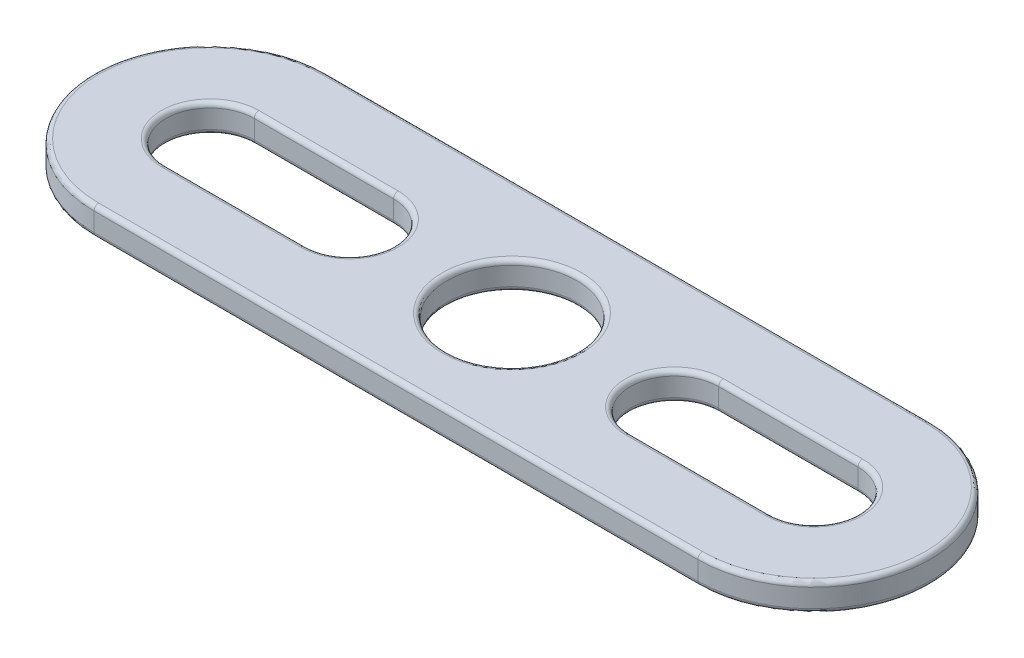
ISO-10303-21;
HEADER;
FILE_DESCRIPTION(('STEP AP214'),'2;1');
FILE_NAME('part.step','',(''),(''),'','','');
FILE_SCHEMA(('AUTOMOTIVE_DESIGN { 1 0 10303 214 1 1 1 1 }'));
ENDSEC;
DATA;
#1=APPLICATION_CONTEXT('core data for automotive mechanical design processes');
#2=APPLICATION_PROTOCOL_DEFINITION('international standard','automotive_design',2000,#1);
#3=PRODUCT_CONTEXT('',#1,'mechanical');
#4=PRODUCT('Part','Part','',(#3));
#5=PRODUCT_RELATED_PRODUCT_CATEGORY('part','',(#4));
#6=PRODUCT_DEFINITION_FORMATION('','',#4);
#7=PRODUCT_DEFINITION_CONTEXT('part definition',#1,'design');
#8=PRODUCT_DEFINITION('design','',#6,#7);
#9=PRODUCT_DEFINITION_SHAPE('','',#8);
#10=(LENGTH_UNIT() NAMED_UNIT(*) SI_UNIT(.MILLI.,.METRE.));
#11=(NAMED_UNIT(*) PLANE_ANGLE_UNIT() SI_UNIT($,.RADIAN.));
#12=(NAMED_UNIT(*) SI_UNIT($,.STERADIAN.) SOLID_ANGLE_UNIT());
#13=UNCERTAINTY_MEASURE_WITH_UNIT(LENGTH_MEASURE(1.E-05),#10,'distance_accuracy_value','');
#14=(GEOMETRIC_REPRESENTATION_CONTEXT(3) GLOBAL_UNCERTAINTY_ASSIGNED_CONTEXT((#13)) GLOBAL_UNIT_ASSIGNED_CONTEXT((#10,
#11,#12)) REPRESENTATION_CONTEXT('',''));
#15=CARTESIAN_POINT('',(0.,0.,0.));
#16=DIRECTION('',(0.,0.,1.));
#17=DIRECTION('',(1.,0.,0.));
#18=AXIS2_PLACEMENT_3D('',#15,#16,#17);
#19=CARTESIAN_POINT('',(0.,1.524,-6.35));
#20=DIRECTION('',(0.,1.,0.));
#21=DIRECTION('',(0.,0.,1.));
#22=AXIS2_PLACEMENT_3D('',#19,#20,#21);
#23=PLANE('',#22);
#24=DIRECTION('',(-1.,0.,0.));
#25=VECTOR('',#24,1.);
#26=CARTESIAN_POINT('',(0.,1.524,-9.01700000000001));
#27=LINE('',#26,#25);
#28=CARTESIAN_POINT('',(25.4,1.524,-9.017));
#29=VERTEX_POINT('',#28);
#30=CARTESIAN_POINT('',(33.02,1.524,-9.017));
#31=VERTEX_POINT('',#30);
#32=EDGE_CURVE('E34',#29,#31,#27,.F.);
#33=ORIENTED_EDGE('',*,*,#32,.T.);
#34=CARTESIAN_POINT('',(33.02,1.524,-6.35));
#35=DIRECTION('',(0.,1.,0.));
#36=DIRECTION('',(0.,0.,1.));
#37=AXIS2_PLACEMENT_3D('',#34,#35,#36);
#38=CIRCLE('',#37,2.667);
#39=CARTESIAN_POINT('',(33.02,1.524,-3.683));
#40=VERTEX_POINT('',#39);
#41=EDGE_CURVE('E11',#31,#40,#38,.F.);
#42=ORIENTED_EDGE('',*,*,#41,.T.);
#43=DIRECTION('',(1.,0.,0.));
#44=VECTOR('',#43,1.);
#45=CARTESIAN_POINT('',(0.,1.524,-3.683));
#46=LINE('',#45,#44);
#47=CARTESIAN_POINT('',(25.4,1.524,-3.683));
#48=VERTEX_POINT('',#47);
#49=EDGE_CURVE('E316',#40,#48,#46,.F.);
#50=ORIENTED_EDGE('',*,*,#49,.T.);
#51=CARTESIAN_POINT('',(25.4,1.524,-6.35));
#52=DIRECTION('',(0.,1.,0.));
#53=DIRECTION('',(0.,0.,1.));
#54=AXIS2_PLACEMENT_3D('',#51,#52,#53);
#55=CIRCLE('',#54,2.667);
#56=EDGE_CURVE('E44',#48,#29,#55,.F.);
#57=ORIENTED_EDGE('',*,*,#56,.T.);
#58=EDGE_LOOP('',(#33,#42,#50,#57));
#59=FACE_BOUND('',#58,.T.);
#60=CARTESIAN_POINT('',(16.51,1.524,-6.35));
#61=DIRECTION('',(0.,1.,0.));
#62=DIRECTION('',(0.,0.,1.));
#63=AXIS2_PLACEMENT_3D('',#60,#61,#62);
#64=CIRCLE('',#63,3.81);
#65=CARTESIAN_POINT('',(16.51,1.524,-2.54));
#66=VERTEX_POINT('',#65);
#67=EDGE_CURVE('E313',#66,#66,#64,.F.);
#68=ORIENTED_EDGE('',*,*,#67,.T.);
#69=EDGE_LOOP('',(#68));
#70=FACE_BOUND('',#69,.T.);
#71=CARTESIAN_POINT('',(33.02,1.524,-6.35));
#72=DIRECTION('',(0.,1.,0.));
#73=DIRECTION('',(0.,0.,1.));
#74=AXIS2_PLACEMENT_3D('',#71,#72,#73);
#75=CIRCLE('',#74,6.096);
#76=CARTESIAN_POINT('',(33.02,1.524,-0.254));
#77=VERTEX_POINT('',#76);
#78=CARTESIAN_POINT('',(33.02,1.524,-12.446));
#79=VERTEX_POINT('',#78);
#80=EDGE_CURVE('E308',#77,#79,#75,.T.);
#81=ORIENTED_EDGE('',*,*,#80,.T.);
#82=DIRECTION('',(-1.,0.,0.));
#83=VECTOR('',#82,1.);
#84=CARTESIAN_POINT('',(0.,1.524,-12.446));
#85=LINE('',#84,#83);
#86=CARTESIAN_POINT('',(0.,1.524,-12.446));
#87=VERTEX_POINT('',#86);
#88=EDGE_CURVE('E310',#79,#87,#85,.T.);
#89=ORIENTED_EDGE('',*,*,#88,.T.);
#90=CARTESIAN_POINT('',(0.,1.524,-6.35));
#91=DIRECTION('',(0.,1.,0.));
#92=DIRECTION('',(0.,0.,1.));
#93=AXIS2_PLACEMENT_3D('',#90,#91,#92);
#94=CIRCLE('',#93,6.096);
#95=CARTESIAN_POINT('',(0.,1.524,-0.254));
#96=VERTEX_POINT('',#95);
#97=EDGE_CURVE('E304',#87,#96,#94,.T.);
#98=ORIENTED_EDGE('',*,*,#97,.T.);
#99=DIRECTION('',(1.,0.,0.));
#100=VECTOR('',#99,1.);
#101=CARTESIAN_POINT('',(33.02,1.524,-0.254));
#102=LINE('',#101,#100);
#103=EDGE_CURVE('E306',#96,#77,#102,.T.);
#104=ORIENTED_EDGE('',*,*,#103,.T.);
#105=EDGE_LOOP('',(#81,#89,#98,#104));
#106=FACE_BOUND('',#105,.T.);
#107=DIRECTION('',(-1.,0.,0.));
#108=VECTOR('',#107,1.);
#109=CARTESIAN_POINT('',(0.,1.524,-9.017));
#110=LINE('',#109,#108);
#111=CARTESIAN_POINT('',(0.,1.524,-9.017));
#112=VERTEX_POINT('',#111);
#113=CARTESIAN_POINT('',(7.62,1.524,-9.017));
#114=VERTEX_POINT('',#113);
#115=EDGE_CURVE('E299',#112,#114,#110,.F.);
#116=ORIENTED_EDGE('',*,*,#115,.T.);
#117=CARTESIAN_POINT('',(7.62,1.524,-6.35));
#118=DIRECTION('',(0.,1.,0.));
#119=DIRECTION('',(0.,0.,1.));
#120=AXIS2_PLACEMENT_3D('',#117,#118,#119);
#121=CIRCLE('',#120,2.667);
#122=CARTESIAN_POINT('',(7.62,1.524,-3.683));
#123=VERTEX_POINT('',#122);
#124=EDGE_CURVE('E301',#114,#123,#121,.F.);
#125=ORIENTED_EDGE('',*,*,#124,.T.);
#126=DIRECTION('',(1.,0.,0.));
#127=VECTOR('',#126,1.);
#128=CARTESIAN_POINT('',(0.,1.524,-3.683));
#129=LINE('',#128,#127);
#130=CARTESIAN_POINT('',(0.,1.524,-3.683));
#131=VERTEX_POINT('',#130);
#132=EDGE_CURVE('E295',#123,#131,#129,.F.);
#133=ORIENTED_EDGE('',*,*,#132,.T.);
#134=CARTESIAN_POINT('',(0.,1.524,-6.35));
#135=DIRECTION('',(0.,1.,0.));
#136=DIRECTION('',(0.,0.,1.));
#137=AXIS2_PLACEMENT_3D('',#134,#135,#136);
#138=CIRCLE('',#137,2.667);
#139=EDGE_CURVE('E297',#131,#112,#138,.F.);
#140=ORIENTED_EDGE('',*,*,#139,.T.);
#141=EDGE_LOOP('',(#116,#125,#133,#140));
#142=FACE_BOUND('',#141,.T.);
#143=ADVANCED_FACE('F26',(#59,#70,#106,#142),#23,.T.);
#144=CARTESIAN_POINT('',(0.,0.,-6.35));
#145=DIRECTION('',(0.,1.,0.));
#146=DIRECTION('',(0.,0.,1.));
#147=AXIS2_PLACEMENT_3D('',#144,#145,#146);
#148=PLANE('',#147);
#149=CARTESIAN_POINT('',(33.02,0.,-6.35));
#150=DIRECTION('',(0.,1.,0.));
#151=DIRECTION('',(0.,0.,1.));
#152=AXIS2_PLACEMENT_3D('',#149,#150,#151);
#153=CIRCLE('',#152,2.667);
#154=CARTESIAN_POINT('',(33.02,0.,-3.683));
#155=VERTEX_POINT('',#154);
#156=CARTESIAN_POINT('',(33.02,0.,-9.017));
#157=VERTEX_POINT('',#156);
#158=EDGE_CURVE('E232',#155,#157,#153,.T.);
#159=ORIENTED_EDGE('',*,*,#158,.T.);
#160=DIRECTION('',(-1.,0.,0.));
#161=VECTOR('',#160,1.);
#162=CARTESIAN_POINT('',(25.4,0.,-9.017));
#163=LINE('',#162,#161);
#164=CARTESIAN_POINT('',(25.4,0.,-9.017));
#165=VERTEX_POINT('',#164);
#166=EDGE_CURVE('E234',#157,#165,#163,.T.);
#167=ORIENTED_EDGE('',*,*,#166,.T.);
#168=CARTESIAN_POINT('',(25.4,0.,-6.35));
#169=DIRECTION('',(0.,1.,0.));
#170=DIRECTION('',(0.,0.,1.));
#171=AXIS2_PLACEMENT_3D('',#168,#169,#170);
#172=CIRCLE('',#171,2.667);
#173=CARTESIAN_POINT('',(25.4,0.,-3.683));
#174=VERTEX_POINT('',#173);
#175=EDGE_CURVE('E228',#165,#174,#172,.T.);
#176=ORIENTED_EDGE('',*,*,#175,.T.);
#177=DIRECTION('',(1.,0.,0.));
#178=VECTOR('',#177,1.);
#179=CARTESIAN_POINT('',(33.02,0.,-3.683));
#180=LINE('',#179,#178);
#181=EDGE_CURVE('E230',#174,#155,#180,.T.);
#182=ORIENTED_EDGE('',*,*,#181,.T.);
#183=EDGE_LOOP('',(#159,#167,#176,#182));
#184=FACE_BOUND('',#183,.T.);
#185=CARTESIAN_POINT('',(16.51,0.,-6.35));
#186=DIRECTION('',(0.,1.,0.));
#187=DIRECTION('',(0.,0.,1.));
#188=AXIS2_PLACEMENT_3D('',#185,#186,#187);
#189=CIRCLE('',#188,3.81);
#190=CARTESIAN_POINT('',(16.51,0.,-2.54));
#191=VERTEX_POINT('',#190);
#192=EDGE_CURVE('E225',#191,#191,#189,.T.);
#193=ORIENTED_EDGE('',*,*,#192,.T.);
#194=EDGE_LOOP('',(#193));
#195=FACE_BOUND('',#194,.T.);
#196=CARTESIAN_POINT('',(33.02,0.,-6.35));
#197=DIRECTION('',(0.,1.,0.));
#198=DIRECTION('',(0.,0.,1.));
#199=AXIS2_PLACEMENT_3D('',#196,#197,#198);
#200=CIRCLE('',#199,6.096);
#201=CARTESIAN_POINT('',(33.02,0.,-12.446));
#202=VERTEX_POINT('',#201);
#203=CARTESIAN_POINT('',(33.02,0.,-0.254));
#204=VERTEX_POINT('',#203);
#205=EDGE_CURVE('E220',#202,#204,#200,.F.);
#206=ORIENTED_EDGE('',*,*,#205,.T.);
#207=DIRECTION('',(1.,0.,0.));
#208=VECTOR('',#207,1.);
#209=CARTESIAN_POINT('',(0.,0.,-0.254));
#210=LINE('',#209,#208);
#211=CARTESIAN_POINT('',(0.,0.,-0.254));
#212=VERTEX_POINT('',#211);
#213=EDGE_CURVE('E222',#204,#212,#210,.F.);
#214=ORIENTED_EDGE('',*,*,#213,.T.);
#215=CARTESIAN_POINT('',(0.,0.,-6.35));
#216=DIRECTION('',(0.,1.,0.));
#217=DIRECTION('',(0.,0.,1.));
#218=AXIS2_PLACEMENT_3D('',#215,#216,#217);
#219=CIRCLE('',#218,6.096);
#220=CARTESIAN_POINT('',(0.,0.,-12.446));
#221=VERTEX_POINT('',#220);
#222=EDGE_CURVE('E212',#212,#221,#219,.F.);
#223=ORIENTED_EDGE('',*,*,#222,.T.);
#224=DIRECTION('',(-1.,0.,0.));
#225=VECTOR('',#224,1.);
#226=CARTESIAN_POINT('',(0.,0.,-12.446));
#227=LINE('',#226,#225);
#228=EDGE_CURVE('E214',#221,#202,#227,.F.);
#229=ORIENTED_EDGE('',*,*,#228,.T.);
#230=EDGE_LOOP('',(#206,#214,#223,#229));
#231=FACE_BOUND('',#230,.T.);
#232=CARTESIAN_POINT('',(7.62,0.,-6.35));
#233=DIRECTION('',(0.,1.,0.));
#234=DIRECTION('',(0.,0.,1.));
#235=AXIS2_PLACEMENT_3D('',#232,#233,#234);
#236=CIRCLE('',#235,2.667);
#237=CARTESIAN_POINT('',(7.62,0.,-3.683));
#238=VERTEX_POINT('',#237);
#239=CARTESIAN_POINT('',(7.62,0.,-9.017));
#240=VERTEX_POINT('',#239);
#241=EDGE_CURVE('E210',#238,#240,#236,.T.);
#242=ORIENTED_EDGE('',*,*,#241,.T.);
#243=DIRECTION('',(-1.,0.,0.));
#244=VECTOR('',#243,1.);
#245=CARTESIAN_POINT('',(0.,0.,-9.017));
#246=LINE('',#245,#244);
#247=CARTESIAN_POINT('',(0.,0.,-9.017));
#248=VERTEX_POINT('',#247);
#249=EDGE_CURVE('E190',#240,#248,#246,.T.);
#250=ORIENTED_EDGE('',*,*,#249,.T.);
#251=CARTESIAN_POINT('',(0.,0.,-6.35));
#252=DIRECTION('',(0.,1.,0.));
#253=DIRECTION('',(0.,0.,1.));
#254=AXIS2_PLACEMENT_3D('',#251,#252,#253);
#255=CIRCLE('',#254,2.667);
#256=CARTESIAN_POINT('',(0.,0.,-3.683));
#257=VERTEX_POINT('',#256);
#258=EDGE_CURVE('E199',#248,#257,#255,.T.);
#259=ORIENTED_EDGE('',*,*,#258,.T.);
#260=DIRECTION('',(1.,0.,0.));
#261=VECTOR('',#260,1.);
#262=CARTESIAN_POINT('',(7.62,0.,-3.683));
#263=LINE('',#262,#261);
#264=EDGE_CURVE('E205',#257,#238,#263,.T.);
#265=ORIENTED_EDGE('',*,*,#264,.T.);
#266=EDGE_LOOP('',(#242,#250,#259,#265));
#267=FACE_BOUND('',#266,.T.);
#268=ADVANCED_FACE('F208',(#184,#195,#231,#267),#148,.F.);
#269=CARTESIAN_POINT('',(0.,1.524,-6.35));
#270=DIRECTION('',(0.,-1.,0.));
#271=DIRECTION('',(0.,0.,-1.));
#272=AXIS2_PLACEMENT_3D('',#269,#270,#271);
#273=CYLINDRICAL_SURFACE('',#272,6.35);
#274=DIRECTION('',(0.,-1.,0.));
#275=VECTOR('',#274,1.);
#276=CARTESIAN_POINT('',(0.,1.524,-12.7));
#277=LINE('',#276,#275);
#278=CARTESIAN_POINT('',(0.,1.27,-12.7));
#279=VERTEX_POINT('',#278);
#280=CARTESIAN_POINT('',(0.,0.254000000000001,-12.7));
#281=VERTEX_POINT('',#280);
#282=EDGE_CURVE('E385',#279,#281,#277,.T.);
#283=ORIENTED_EDGE('',*,*,#282,.T.);
#284=CARTESIAN_POINT('',(0.,0.254,-6.35));
#285=DIRECTION('',(0.,1.,0.));
#286=DIRECTION('',(0.,0.,1.));
#287=AXIS2_PLACEMENT_3D('',#284,#285,#286);
#288=CIRCLE('',#287,6.35);
#289=CARTESIAN_POINT('',(0.,0.254000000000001,0.));
#290=VERTEX_POINT('',#289);
#291=EDGE_CURVE('E277',#281,#290,#288,.T.);
#292=ORIENTED_EDGE('',*,*,#291,.T.);
#293=DIRECTION('',(0.,-1.,0.));
#294=VECTOR('',#293,1.);
#295=CARTESIAN_POINT('',(0.,1.524,0.));
#296=LINE('',#295,#294);
#297=CARTESIAN_POINT('',(0.,1.27,0.));
#298=VERTEX_POINT('',#297);
#299=EDGE_CURVE('E206',#298,#290,#296,.T.);
#300=ORIENTED_EDGE('',*,*,#299,.F.);
#301=CARTESIAN_POINT('',(0.,1.27,-6.35));
#302=DIRECTION('',(0.,1.,0.));
#303=DIRECTION('',(0.,0.,1.));
#304=AXIS2_PLACEMENT_3D('',#301,#302,#303);
#305=CIRCLE('',#304,6.35);
#306=EDGE_CURVE('E275',#298,#279,#305,.F.);
#307=ORIENTED_EDGE('',*,*,#306,.T.);
#308=EDGE_LOOP('',(#283,#292,#300,#307));
#309=FACE_BOUND('',#308,.T.);
#310=ADVANCED_FACE('F28',(#309),#273,.T.);
#311=CARTESIAN_POINT('',(0.,1.524,0.));
#312=DIRECTION('',(0.,0.,-1.));
#313=DIRECTION('',(-1.,0.,0.));
#314=AXIS2_PLACEMENT_3D('',#311,#312,#313);
#315=PLANE('',#314);
#316=ORIENTED_EDGE('',*,*,#299,.T.);
#317=DIRECTION('',(1.,0.,0.));
#318=VECTOR('',#317,1.);
#319=CARTESIAN_POINT('',(0.,0.254,0.));
#320=LINE('',#319,#318);
#321=CARTESIAN_POINT('',(33.02,0.254000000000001,0.));
#322=VERTEX_POINT('',#321);
#323=EDGE_CURVE('E263',#290,#322,#320,.T.);
#324=ORIENTED_EDGE('',*,*,#323,.T.);
#325=DIRECTION('',(0.,-1.,0.));
#326=VECTOR('',#325,1.);
#327=CARTESIAN_POINT('',(33.02,1.524,0.));
#328=LINE('',#327,#326);
#329=CARTESIAN_POINT('',(33.02,1.27,0.));
#330=VERTEX_POINT('',#329);
#331=EDGE_CURVE('E391',#330,#322,#328,.T.);
#332=ORIENTED_EDGE('',*,*,#331,.F.);
#333=DIRECTION('',(1.,0.,0.));
#334=VECTOR('',#333,1.);
#335=CARTESIAN_POINT('',(0.,1.27,0.));
#336=LINE('',#335,#334);
#337=EDGE_CURVE('E261',#330,#298,#336,.F.);
#338=ORIENTED_EDGE('',*,*,#337,.T.);
#339=EDGE_LOOP('',(#316,#324,#332,#338));
#340=FACE_BOUND('',#339,.T.);
#341=ADVANCED_FACE('F467',(#340),#315,.F.);
#342=CARTESIAN_POINT('',(33.02,1.524,-6.35));
#343=DIRECTION('',(0.,-1.,0.));
#344=DIRECTION('',(0.,0.,-1.));
#345=AXIS2_PLACEMENT_3D('',#342,#343,#344);
#346=CYLINDRICAL_SURFACE('',#345,6.35);
#347=ORIENTED_EDGE('',*,*,#331,.T.);
#348=CARTESIAN_POINT('',(33.02,0.254,-6.35));
#349=DIRECTION('',(0.,1.,0.));
#350=DIRECTION('',(0.,0.,1.));
#351=AXIS2_PLACEMENT_3D('',#348,#349,#350);
#352=CIRCLE('',#351,6.35);
#353=CARTESIAN_POINT('',(33.02,0.254000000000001,-12.7));
#354=VERTEX_POINT('',#353);
#355=EDGE_CURVE('E268',#322,#354,#352,.T.);
#356=ORIENTED_EDGE('',*,*,#355,.T.);
#357=DIRECTION('',(0.,-1.,0.));
#358=VECTOR('',#357,1.);
#359=CARTESIAN_POINT('',(33.02,1.524,-12.7));
#360=LINE('',#359,#358);
#361=CARTESIAN_POINT('',(33.02,1.27,-12.7));
#362=VERTEX_POINT('',#361);
#363=EDGE_CURVE('E388',#362,#354,#360,.T.);
#364=ORIENTED_EDGE('',*,*,#363,.F.);
#365=CARTESIAN_POINT('',(33.02,1.27,-6.35));
#366=DIRECTION('',(0.,1.,0.));
#367=DIRECTION('',(0.,0.,1.));
#368=AXIS2_PLACEMENT_3D('',#365,#366,#367);
#369=CIRCLE('',#368,6.35);
#370=EDGE_CURVE('E266',#362,#330,#369,.F.);
#371=ORIENTED_EDGE('',*,*,#370,.T.);
#372=EDGE_LOOP('',(#347,#356,#364,#371));
#373=FACE_BOUND('',#372,.T.);
#374=ADVANCED_FACE('F464',(#373),#346,.T.);
#375=CARTESIAN_POINT('',(0.,1.524,-12.7));
#376=DIRECTION('',(0.,0.,1.));
#377=DIRECTION('',(1.,0.,0.));
#378=AXIS2_PLACEMENT_3D('',#375,#376,#377);
#379=PLANE('',#378);
#380=ORIENTED_EDGE('',*,*,#363,.T.);
#381=DIRECTION('',(-1.,0.,0.));
#382=VECTOR('',#381,1.);
#383=CARTESIAN_POINT('',(0.,0.254,-12.7));
#384=LINE('',#383,#382);
#385=EDGE_CURVE('E273',#354,#281,#384,.T.);
#386=ORIENTED_EDGE('',*,*,#385,.T.);
#387=ORIENTED_EDGE('',*,*,#282,.F.);
#388=DIRECTION('',(-1.,0.,0.));
#389=VECTOR('',#388,1.);
#390=CARTESIAN_POINT('',(33.02,1.27,-12.7));
#391=LINE('',#390,#389);
#392=EDGE_CURVE('E270',#279,#362,#391,.F.);
#393=ORIENTED_EDGE('',*,*,#392,.T.);
#394=EDGE_LOOP('',(#380,#386,#387,#393));
#395=FACE_BOUND('',#394,.T.);
#396=ADVANCED_FACE('F461',(#395),#379,.F.);
#397=CARTESIAN_POINT('',(16.51,1.524,-6.35));
#398=DIRECTION('',(0.,-1.,0.));
#399=DIRECTION('',(0.,0.,-1.));
#400=AXIS2_PLACEMENT_3D('',#397,#398,#399);
#401=CYLINDRICAL_SURFACE('',#400,3.556);
#402=CARTESIAN_POINT('',(16.51,0.254,-6.35));
#403=DIRECTION('',(0.,1.,0.));
#404=DIRECTION('',(0.,0.,1.));
#405=AXIS2_PLACEMENT_3D('',#402,#403,#404);
#406=CIRCLE('',#405,3.556);
#407=CARTESIAN_POINT('',(16.51,0.254,-9.906));
#408=VERTEX_POINT('',#407);
#409=EDGE_CURVE('E258',#408,#408,#406,.F.);
#410=CARTESIAN_POINT('',(16.51,1.27,-6.35));
#411=DIRECTION('',(0.,1.,0.));
#412=DIRECTION('',(0.,0.,1.));
#413=AXIS2_PLACEMENT_3D('',#410,#411,#412);
#414=CIRCLE('',#413,3.556);
#415=CARTESIAN_POINT('',(16.51,1.27,-9.906));
#416=VERTEX_POINT('',#415);
#417=EDGE_CURVE('E255',#416,#416,#414,.T.);
#418=CARTESIAN_POINT('',(16.51,0.254,-9.906));
#419=CARTESIAN_POINT('',(16.51,0.264583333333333,-9.906));
#420=CARTESIAN_POINT('',(16.51,0.275166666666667,-9.906));
#421=CARTESIAN_POINT('',(16.51,0.296333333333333,-9.906));
#422=CARTESIAN_POINT('',(16.51,0.306916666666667,-9.906));
#423=CARTESIAN_POINT('',(16.51,0.328083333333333,-9.906));
#424=CARTESIAN_POINT('',(16.51,0.338666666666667,-9.906));
#425=CARTESIAN_POINT('',(16.51,0.359833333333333,-9.906));
#426=CARTESIAN_POINT('',(16.51,0.370416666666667,-9.906));
#427=CARTESIAN_POINT('',(16.51,0.391583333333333,-9.906));
#428=CARTESIAN_POINT('',(16.51,0.402166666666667,-9.906));
#429=CARTESIAN_POINT('',(16.51,0.423333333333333,-9.906));
#430=CARTESIAN_POINT('',(16.51,0.433916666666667,-9.906));
#431=CARTESIAN_POINT('',(16.51,0.455083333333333,-9.906));
#432=CARTESIAN_POINT('',(16.51,0.465666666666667,-9.906));
#433=CARTESIAN_POINT('',(16.51,0.486833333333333,-9.906));
#434=CARTESIAN_POINT('',(16.51,0.497416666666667,-9.906));
#435=CARTESIAN_POINT('',(16.51,0.518583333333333,-9.906));
#436=CARTESIAN_POINT('',(16.51,0.529166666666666,-9.906));
#437=CARTESIAN_POINT('',(16.51,0.550333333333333,-9.906));
#438=CARTESIAN_POINT('',(16.51,0.560916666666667,-9.906));
#439=CARTESIAN_POINT('',(16.51,0.582083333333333,-9.906));
#440=CARTESIAN_POINT('',(16.51,0.592666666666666,-9.906));
#441=CARTESIAN_POINT('',(16.51,0.613833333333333,-9.906));
#442=CARTESIAN_POINT('',(16.51,0.624416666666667,-9.906));
#443=CARTESIAN_POINT('',(16.51,0.645583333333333,-9.906));
#444=CARTESIAN_POINT('',(16.51,0.656166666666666,-9.906));
#445=CARTESIAN_POINT('',(16.51,0.677333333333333,-9.906));
#446=CARTESIAN_POINT('',(16.51,0.687916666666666,-9.906));
#447=CARTESIAN_POINT('',(16.51,0.709083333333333,-9.906));
#448=CARTESIAN_POINT('',(16.51,0.719666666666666,-9.906));
#449=CARTESIAN_POINT('',(16.51,0.740833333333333,-9.906));
#450=CARTESIAN_POINT('',(16.51,0.751416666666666,-9.906));
#451=CARTESIAN_POINT('',(16.51,0.772583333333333,-9.906));
#452=CARTESIAN_POINT('',(16.51,0.783166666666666,-9.906));
#453=CARTESIAN_POINT('',(16.51,0.804333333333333,-9.906));
#454=CARTESIAN_POINT('',(16.51,0.814916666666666,-9.906));
#455=CARTESIAN_POINT('',(16.51,0.836083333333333,-9.906));
#456=CARTESIAN_POINT('',(16.51,0.846666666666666,-9.906));
#457=CARTESIAN_POINT('',(16.51,0.867833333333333,-9.906));
#458=CARTESIAN_POINT('',(16.51,0.878416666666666,-9.906));
#459=CARTESIAN_POINT('',(16.51,0.899583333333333,-9.906));
#460=CARTESIAN_POINT('',(16.51,0.910166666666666,-9.906));
#461=CARTESIAN_POINT('',(16.51,0.931333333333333,-9.906));
#462=CARTESIAN_POINT('',(16.51,0.941916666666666,-9.906));
#463=CARTESIAN_POINT('',(16.51,0.963083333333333,-9.906));
#464=CARTESIAN_POINT('',(16.51,0.973666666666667,-9.906));
#465=CARTESIAN_POINT('',(16.51,0.994833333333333,-9.906));
#466=CARTESIAN_POINT('',(16.51,1.00541666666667,-9.906));
#467=CARTESIAN_POINT('',(16.51,1.02658333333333,-9.906));
#468=CARTESIAN_POINT('',(16.51,1.03716666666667,-9.906));
#469=CARTESIAN_POINT('',(16.51,1.05833333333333,-9.906));
#470=CARTESIAN_POINT('',(16.51,1.06891666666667,-9.906));
#471=CARTESIAN_POINT('',(16.51,1.09008333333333,-9.906));
#472=CARTESIAN_POINT('',(16.51,1.10066666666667,-9.906));
#473=CARTESIAN_POINT('',(16.51,1.12183333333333,-9.906));
#474=CARTESIAN_POINT('',(16.51,1.13241666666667,-9.906));
#475=CARTESIAN_POINT('',(16.51,1.15358333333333,-9.906));
#476=CARTESIAN_POINT('',(16.51,1.16416666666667,-9.906));
#477=CARTESIAN_POINT('',(16.51,1.18533333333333,-9.906));
#478=CARTESIAN_POINT('',(16.51,1.19591666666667,-9.906));
#479=CARTESIAN_POINT('',(16.51,1.21708333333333,-9.906));
#480=CARTESIAN_POINT('',(16.51,1.22766666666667,-9.906));
#481=CARTESIAN_POINT('',(16.51,1.24883333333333,-9.906));
#482=CARTESIAN_POINT('',(16.51,1.25941666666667,-9.906));
#483=CARTESIAN_POINT('',(16.51,1.27,-9.906));
#484=B_SPLINE_CURVE_WITH_KNOTS('',3,(#418,#419,#420,#421,#422,#423,#424,#425,#426,#427,#428,
#429,#430,#431,#432,#433,#434,#435,#436,#437,#438,#439,#440,#441,#442,#443,#444,#445,#446,#447,
#448,#449,#450,#451,#452,#453,#454,#455,#456,#457,#458,#459,#460,#461,#462,#463,#464,#465,#466,
#467,#468,#469,#470,#471,#472,#473,#474,#475,#476,#477,#478,#479,#480,#481,#482,#483),
.UNSPECIFIED.,.F.,.F.,(4,2,2,2,2,2,2,2,2,2,2,2,2,2,2,2,2,2,2,2,2,2,2,2,2,2,2,2,2,2,2,2,4),(0.,
0.0317500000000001,0.0635,0.0952500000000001,0.127,0.15875,0.1905,0.22225,0.254,0.28575,0.3175,
0.34925,0.381,0.41275,0.4445,0.47625,0.508,0.53975,0.5715,0.60325,0.635,0.66675,0.6985,0.73025,
0.762,0.79375,0.8255,0.85725,0.889,0.92075,0.9525,0.98425,1.016),.UNSPECIFIED.);
#485=EDGE_CURVE('BSEAM450',#408,#416,#484,.T.);
#486=ORIENTED_EDGE('',*,*,#409,.T.);
#487=ORIENTED_EDGE('',*,*,#417,.T.);
#488=ORIENTED_EDGE('',*,*,#485,.T.);
#489=ORIENTED_EDGE('',*,*,#485,.F.);
#490=EDGE_LOOP('',(#486,#488,#487,#489));
#491=FACE_BOUND('',#490,.T.);
#492=ADVANCED_FACE('F450',(#491),#401,.F.);
#493=CARTESIAN_POINT('',(0.,1.524,-6.35));
#494=DIRECTION('',(0.,-1.,0.));
#495=DIRECTION('',(0.,0.,-1.));
#496=AXIS2_PLACEMENT_3D('',#493,#494,#495);
#497=CYLINDRICAL_SURFACE('',#496,2.413);
#498=DIRECTION('',(0.,-1.,0.));
#499=VECTOR('',#498,1.);
#500=CARTESIAN_POINT('',(0.,1.524,-3.937));
#501=LINE('',#500,#499);
#502=CARTESIAN_POINT('',(0.,1.27,-3.937));
#503=VERTEX_POINT('',#502);
#504=CARTESIAN_POINT('',(0.,0.254000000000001,-3.937));
#505=VERTEX_POINT('',#504);
#506=EDGE_CURVE('E382',#503,#505,#501,.T.);
#507=ORIENTED_EDGE('',*,*,#506,.T.);
#508=CARTESIAN_POINT('',(0.,0.254,-6.35));
#509=DIRECTION('',(0.,1.,0.));
#510=DIRECTION('',(0.,0.,1.));
#511=AXIS2_PLACEMENT_3D('',#508,#509,#510);
#512=CIRCLE('',#511,2.413);
#513=CARTESIAN_POINT('',(0.,0.254000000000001,-8.763));
#514=VERTEX_POINT('',#513);
#515=EDGE_CURVE('E293',#505,#514,#512,.F.);
#516=ORIENTED_EDGE('',*,*,#515,.T.);
#517=DIRECTION('',(0.,-1.,0.));
#518=VECTOR('',#517,1.);
#519=CARTESIAN_POINT('',(0.,1.524,-8.763));
#520=LINE('',#519,#518);
#521=CARTESIAN_POINT('',(0.,1.27,-8.763));
#522=VERTEX_POINT('',#521);
#523=EDGE_CURVE('E373',#522,#514,#520,.T.);
#524=ORIENTED_EDGE('',*,*,#523,.F.);
#525=CARTESIAN_POINT('',(0.,1.27,-6.35));
#526=DIRECTION('',(0.,1.,0.));
#527=DIRECTION('',(0.,0.,1.));
#528=AXIS2_PLACEMENT_3D('',#525,#526,#527);
#529=CIRCLE('',#528,2.413);
#530=EDGE_CURVE('E291',#522,#503,#529,.T.);
#531=ORIENTED_EDGE('',*,*,#530,.T.);
#532=EDGE_LOOP('',(#507,#516,#524,#531));
#533=FACE_BOUND('',#532,.T.);
#534=ADVANCED_FACE('F428',(#533),#497,.F.);
#535=CARTESIAN_POINT('',(0.,1.524,-3.937));
#536=DIRECTION('',(0.,0.,-1.));
#537=DIRECTION('',(-1.,0.,0.));
#538=AXIS2_PLACEMENT_3D('',#535,#536,#537);
#539=PLANE('',#538);
#540=DIRECTION('',(0.,-1.,0.));
#541=VECTOR('',#540,1.);
#542=CARTESIAN_POINT('',(7.62,1.524,-3.937));
#543=LINE('',#542,#541);
#544=CARTESIAN_POINT('',(7.62,1.27,-3.937));
#545=VERTEX_POINT('',#544);
#546=CARTESIAN_POINT('',(7.62,0.254000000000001,-3.937));
#547=VERTEX_POINT('',#546);
#548=EDGE_CURVE('E379',#545,#547,#543,.T.);
#549=ORIENTED_EDGE('',*,*,#548,.T.);
#550=DIRECTION('',(1.,0.,0.));
#551=VECTOR('',#550,1.);
#552=CARTESIAN_POINT('',(0.,0.254,-3.937));
#553=LINE('',#552,#551);
#554=EDGE_CURVE('E289',#547,#505,#553,.F.);
#555=ORIENTED_EDGE('',*,*,#554,.T.);
#556=ORIENTED_EDGE('',*,*,#506,.F.);
#557=DIRECTION('',(1.,0.,0.));
#558=VECTOR('',#557,1.);
#559=CARTESIAN_POINT('',(0.,1.27,-3.937));
#560=LINE('',#559,#558);
#561=EDGE_CURVE('E287',#503,#545,#560,.T.);
#562=ORIENTED_EDGE('',*,*,#561,.T.);
#563=EDGE_LOOP('',(#549,#555,#556,#562));
#564=FACE_BOUND('',#563,.T.);
#565=ADVANCED_FACE('F442',(#564),#539,.T.);
#566=CARTESIAN_POINT('',(7.62,1.524,-6.35));
#567=DIRECTION('',(0.,-1.,0.));
#568=DIRECTION('',(0.,0.,-1.));
#569=AXIS2_PLACEMENT_3D('',#566,#567,#568);
#570=CYLINDRICAL_SURFACE('',#569,2.413);
#571=DIRECTION('',(0.,-1.,0.));
#572=VECTOR('',#571,1.);
#573=CARTESIAN_POINT('',(7.62,1.524,-8.763));
#574=LINE('',#573,#572);
#575=CARTESIAN_POINT('',(7.62,1.27,-8.763));
#576=VERTEX_POINT('',#575);
#577=CARTESIAN_POINT('',(7.62,0.254000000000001,-8.763));
#578=VERTEX_POINT('',#577);
#579=EDGE_CURVE('E376',#576,#578,#574,.T.);
#580=ORIENTED_EDGE('',*,*,#579,.T.);
#581=CARTESIAN_POINT('',(7.62,0.254,-6.35));
#582=DIRECTION('',(0.,1.,0.));
#583=DIRECTION('',(0.,0.,1.));
#584=AXIS2_PLACEMENT_3D('',#581,#582,#583);
#585=CIRCLE('',#584,2.413);
#586=EDGE_CURVE('E285',#578,#547,#585,.F.);
#587=ORIENTED_EDGE('',*,*,#586,.T.);
#588=ORIENTED_EDGE('',*,*,#548,.F.);
#589=CARTESIAN_POINT('',(7.62,1.27,-6.35));
#590=DIRECTION('',(0.,1.,0.));
#591=DIRECTION('',(0.,0.,1.));
#592=AXIS2_PLACEMENT_3D('',#589,#590,#591);
#593=CIRCLE('',#592,2.413);
#594=EDGE_CURVE('E282',#545,#576,#593,.T.);
#595=ORIENTED_EDGE('',*,*,#594,.T.);
#596=EDGE_LOOP('',(#580,#587,#588,#595));
#597=FACE_BOUND('',#596,.T.);
#598=ADVANCED_FACE('F408',(#597),#570,.F.);
#599=CARTESIAN_POINT('',(0.,1.524,-8.763));
#600=DIRECTION('',(0.,0.,1.));
#601=DIRECTION('',(1.,0.,0.));
#602=AXIS2_PLACEMENT_3D('',#599,#600,#601);
#603=PLANE('',#602);
#604=ORIENTED_EDGE('',*,*,#523,.T.);
#605=DIRECTION('',(-1.,0.,0.));
#606=VECTOR('',#605,1.);
#607=CARTESIAN_POINT('',(7.62,0.254,-8.763));
#608=LINE('',#607,#606);
#609=EDGE_CURVE('E192',#514,#578,#608,.F.);
#610=ORIENTED_EDGE('',*,*,#609,.T.);
#611=ORIENTED_EDGE('',*,*,#579,.F.);
#612=DIRECTION('',(-1.,0.,0.));
#613=VECTOR('',#612,1.);
#614=CARTESIAN_POINT('',(0.,1.27,-8.763));
#615=LINE('',#614,#613);
#616=EDGE_CURVE('E279',#576,#522,#615,.T.);
#617=ORIENTED_EDGE('',*,*,#616,.T.);
#618=EDGE_LOOP('',(#604,#610,#611,#617));
#619=FACE_BOUND('',#618,.T.);
#620=ADVANCED_FACE('F406',(#619),#603,.T.);
#621=CARTESIAN_POINT('',(25.4,1.524,-6.35));
#622=DIRECTION('',(0.,-1.,0.));
#623=DIRECTION('',(0.,0.,-1.));
#624=AXIS2_PLACEMENT_3D('',#621,#622,#623);
#625=CYLINDRICAL_SURFACE('',#624,2.413);
#626=DIRECTION('',(0.,-1.,0.));
#627=VECTOR('',#626,1.);
#628=CARTESIAN_POINT('',(25.4,1.524,-3.937));
#629=LINE('',#628,#627);
#630=CARTESIAN_POINT('',(25.4,1.27,-3.937));
#631=VERTEX_POINT('',#630);
#632=CARTESIAN_POINT('',(25.4,0.254000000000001,-3.937));
#633=VERTEX_POINT('',#632);
#634=EDGE_CURVE('E370',#631,#633,#629,.T.);
#635=ORIENTED_EDGE('',*,*,#634,.T.);
#636=CARTESIAN_POINT('',(25.4,0.254,-6.35));
#637=DIRECTION('',(0.,1.,0.));
#638=DIRECTION('',(0.,0.,1.));
#639=AXIS2_PLACEMENT_3D('',#636,#637,#638);
#640=CIRCLE('',#639,2.413);
#641=CARTESIAN_POINT('',(25.4,0.254000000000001,-8.763));
#642=VERTEX_POINT('',#641);
#643=EDGE_CURVE('E253',#633,#642,#640,.F.);
#644=ORIENTED_EDGE('',*,*,#643,.T.);
#645=DIRECTION('',(0.,-1.,0.));
#646=VECTOR('',#645,1.);
#647=CARTESIAN_POINT('',(25.4,1.524,-8.763));
#648=LINE('',#647,#646);
#649=CARTESIAN_POINT('',(25.4,1.27,-8.763));
#650=VERTEX_POINT('',#649);
#651=EDGE_CURVE('E361',#650,#642,#648,.T.);
#652=ORIENTED_EDGE('',*,*,#651,.F.);
#653=CARTESIAN_POINT('',(25.4,1.27,-6.35));
#654=DIRECTION('',(0.,1.,0.));
#655=DIRECTION('',(0.,0.,1.));
#656=AXIS2_PLACEMENT_3D('',#653,#654,#655);
#657=CIRCLE('',#656,2.413);
#658=EDGE_CURVE('E251',#650,#631,#657,.T.);
#659=ORIENTED_EDGE('',*,*,#658,.T.);
#660=EDGE_LOOP('',(#635,#644,#652,#659));
#661=FACE_BOUND('',#660,.T.);
#662=ADVANCED_FACE('F542',(#661),#625,.F.);
#663=CARTESIAN_POINT('',(25.4,1.524,-3.937));
#664=DIRECTION('',(0.,0.,-1.));
#665=DIRECTION('',(-1.,0.,0.));
#666=AXIS2_PLACEMENT_3D('',#663,#664,#665);
#667=PLANE('',#666);
#668=DIRECTION('',(0.,-1.,0.));
#669=VECTOR('',#668,1.);
#670=CARTESIAN_POINT('',(33.02,1.524,-3.937));
#671=LINE('',#670,#669);
#672=CARTESIAN_POINT('',(33.02,1.27,-3.937));
#673=VERTEX_POINT('',#672);
#674=CARTESIAN_POINT('',(33.02,0.254000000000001,-3.937));
#675=VERTEX_POINT('',#674);
#676=EDGE_CURVE('E367',#673,#675,#671,.T.);
#677=ORIENTED_EDGE('',*,*,#676,.T.);
#678=DIRECTION('',(1.,0.,0.));
#679=VECTOR('',#678,1.);
#680=CARTESIAN_POINT('',(25.4,0.254,-3.937));
#681=LINE('',#680,#679);
#682=EDGE_CURVE('E249',#675,#633,#681,.F.);
#683=ORIENTED_EDGE('',*,*,#682,.T.);
#684=ORIENTED_EDGE('',*,*,#634,.F.);
#685=DIRECTION('',(1.,0.,0.));
#686=VECTOR('',#685,1.);
#687=CARTESIAN_POINT('',(25.4,1.27,-3.937));
#688=LINE('',#687,#686);
#689=EDGE_CURVE('E247',#631,#673,#688,.T.);
#690=ORIENTED_EDGE('',*,*,#689,.T.);
#691=EDGE_LOOP('',(#677,#683,#684,#690));
#692=FACE_BOUND('',#691,.T.);
#693=ADVANCED_FACE('F538',(#692),#667,.T.);
#694=CARTESIAN_POINT('',(33.02,1.524,-6.35));
#695=DIRECTION('',(0.,-1.,0.));
#696=DIRECTION('',(0.,0.,-1.));
#697=AXIS2_PLACEMENT_3D('',#694,#695,#696);
#698=CYLINDRICAL_SURFACE('',#697,2.413);
#699=DIRECTION('',(0.,-1.,0.));
#700=VECTOR('',#699,1.);
#701=CARTESIAN_POINT('',(33.02,1.524,-8.763));
#702=LINE('',#701,#700);
#703=CARTESIAN_POINT('',(33.02,1.27,-8.763));
#704=VERTEX_POINT('',#703);
#705=CARTESIAN_POINT('',(33.02,0.254000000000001,-8.763));
#706=VERTEX_POINT('',#705);
#707=EDGE_CURVE('E364',#704,#706,#702,.T.);
#708=ORIENTED_EDGE('',*,*,#707,.T.);
#709=CARTESIAN_POINT('',(33.02,0.254,-6.35));
#710=DIRECTION('',(0.,1.,0.));
#711=DIRECTION('',(0.,0.,1.));
#712=AXIS2_PLACEMENT_3D('',#709,#710,#711);
#713=CIRCLE('',#712,2.413);
#714=EDGE_CURVE('E245',#706,#675,#713,.F.);
#715=ORIENTED_EDGE('',*,*,#714,.T.);
#716=ORIENTED_EDGE('',*,*,#676,.F.);
#717=CARTESIAN_POINT('',(33.02,1.27,-6.35));
#718=DIRECTION('',(0.,1.,0.));
#719=DIRECTION('',(0.,0.,1.));
#720=AXIS2_PLACEMENT_3D('',#717,#718,#719);
#721=CIRCLE('',#720,2.413);
#722=EDGE_CURVE('E242',#673,#704,#721,.T.);
#723=ORIENTED_EDGE('',*,*,#722,.T.);
#724=EDGE_LOOP('',(#708,#715,#716,#723));
#725=FACE_BOUND('',#724,.T.);
#726=ADVANCED_FACE('F534',(#725),#698,.F.);
#727=CARTESIAN_POINT('',(25.4,1.524,-8.763));
#728=DIRECTION('',(0.,0.,1.));
#729=DIRECTION('',(1.,0.,0.));
#730=AXIS2_PLACEMENT_3D('',#727,#728,#729);
#731=PLANE('',#730);
#732=ORIENTED_EDGE('',*,*,#651,.T.);
#733=DIRECTION('',(-1.,0.,0.));
#734=VECTOR('',#733,1.);
#735=CARTESIAN_POINT('',(33.02,0.254,-8.763));
#736=LINE('',#735,#734);
#737=EDGE_CURVE('E239',#642,#706,#736,.F.);
#738=ORIENTED_EDGE('',*,*,#737,.T.);
#739=ORIENTED_EDGE('',*,*,#707,.F.);
#740=DIRECTION('',(-1.,0.,0.));
#741=VECTOR('',#740,1.);
#742=CARTESIAN_POINT('',(25.4,1.27,-8.763));
#743=LINE('',#742,#741);
#744=EDGE_CURVE('E237',#704,#650,#743,.T.);
#745=ORIENTED_EDGE('',*,*,#744,.T.);
#746=EDGE_LOOP('',(#732,#738,#739,#745));
#747=FACE_BOUND('',#746,.T.);
#748=ADVANCED_FACE('F530',(#747),#731,.T.);
#749=CARTESIAN_POINT('',(0.,0.254,-3.683));
#750=DIRECTION('',(-1.,0.,0.));
#751=DIRECTION('',(0.,0.,1.));
#752=AXIS2_PLACEMENT_3D('',#749,#750,#751);
#753=CYLINDRICAL_SURFACE('',#752,0.254);
#754=CARTESIAN_POINT('',(25.4,0.254,-3.683));
#755=DIRECTION('',(-1.,0.,0.));
#756=DIRECTION('',(0.,0.,1.));
#757=AXIS2_PLACEMENT_3D('',#754,#755,#756);
#758=CIRCLE('',#757,0.254);
#759=EDGE_CURVE('E355',#633,#174,#758,.T.);
#760=ORIENTED_EDGE('',*,*,#759,.F.);
#761=ORIENTED_EDGE('',*,*,#682,.F.);
#762=CARTESIAN_POINT('',(33.02,0.254,-3.683));
#763=DIRECTION('',(1.,0.,0.));
#764=DIRECTION('',(0.,0.,-1.));
#765=AXIS2_PLACEMENT_3D('',#762,#763,#764);
#766=CIRCLE('',#765,0.254);
#767=EDGE_CURVE('E358',#155,#675,#766,.T.);
#768=ORIENTED_EDGE('',*,*,#767,.F.);
#769=ORIENTED_EDGE('',*,*,#181,.F.);
#770=EDGE_LOOP('',(#760,#761,#768,#769));
#771=FACE_BOUND('',#770,.T.);
#772=ADVANCED_FACE('F526',(#771),#753,.T.);
#773=CARTESIAN_POINT('',(33.02,0.254,-6.35));
#774=DIRECTION('',(0.,1.,0.));
#775=DIRECTION('',(0.,0.,1.));
#776=AXIS2_PLACEMENT_3D('',#773,#774,#775);
#777=TOROIDAL_SURFACE('',#776,2.667,0.254);
#778=ORIENTED_EDGE('',*,*,#767,.T.);
#779=ORIENTED_EDGE('',*,*,#714,.F.);
#780=CARTESIAN_POINT('',(33.02,0.254,-9.017));
#781=DIRECTION('',(-1.,0.,0.));
#782=DIRECTION('',(0.,0.,1.));
#783=AXIS2_PLACEMENT_3D('',#780,#781,#782);
#784=CIRCLE('',#783,0.254);
#785=EDGE_CURVE('E353',#157,#706,#784,.T.);
#786=ORIENTED_EDGE('',*,*,#785,.F.);
#787=ORIENTED_EDGE('',*,*,#158,.F.);
#788=EDGE_LOOP('',(#778,#779,#786,#787));
#789=FACE_BOUND('',#788,.T.);
#790=ADVANCED_FACE('F522',(#789),#777,.T.);
#791=CARTESIAN_POINT('',(25.4,0.254,-6.35));
#792=DIRECTION('',(0.,1.,0.));
#793=DIRECTION('',(0.,0.,1.));
#794=AXIS2_PLACEMENT_3D('',#791,#792,#793);
#795=TOROIDAL_SURFACE('',#794,2.667,0.254);
#796=ORIENTED_EDGE('',*,*,#759,.T.);
#797=ORIENTED_EDGE('',*,*,#175,.F.);
#798=CARTESIAN_POINT('',(25.4,0.254,-9.017));
#799=DIRECTION('',(1.,0.,0.));
#800=DIRECTION('',(0.,0.,-1.));
#801=AXIS2_PLACEMENT_3D('',#798,#799,#800);
#802=CIRCLE('',#801,0.254);
#803=EDGE_CURVE('E351',#642,#165,#802,.T.);
#804=ORIENTED_EDGE('',*,*,#803,.F.);
#805=ORIENTED_EDGE('',*,*,#643,.F.);
#806=EDGE_LOOP('',(#796,#797,#804,#805));
#807=FACE_BOUND('',#806,.T.);
#808=ADVANCED_FACE('F518',(#807),#795,.T.);
#809=CARTESIAN_POINT('',(0.,0.254,-9.01700000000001));
#810=DIRECTION('',(1.,0.,0.));
#811=DIRECTION('',(0.,0.,-1.));
#812=AXIS2_PLACEMENT_3D('',#809,#810,#811);
#813=CYLINDRICAL_SURFACE('',#812,0.254);
#814=ORIENTED_EDGE('',*,*,#785,.T.);
#815=ORIENTED_EDGE('',*,*,#737,.F.);
#816=ORIENTED_EDGE('',*,*,#803,.T.);
#817=ORIENTED_EDGE('',*,*,#166,.F.);
#818=EDGE_LOOP('',(#814,#815,#816,#817));
#819=FACE_BOUND('',#818,.T.);
#820=ADVANCED_FACE('F511',(#819),#813,.T.);
#821=CARTESIAN_POINT('',(16.51,0.254,-6.35));
#822=DIRECTION('',(0.,1.,0.));
#823=DIRECTION('',(0.,0.,1.));
#824=AXIS2_PLACEMENT_3D('',#821,#822,#823);
#825=TOROIDAL_SURFACE('',#824,3.81,0.254);
#826=ORIENTED_EDGE('',*,*,#409,.F.);
#827=EDGE_LOOP('',(#826));
#828=FACE_BOUND('',#827,.T.);
#829=ORIENTED_EDGE('',*,*,#192,.F.);
#830=EDGE_LOOP('',(#829));
#831=FACE_BOUND('',#830,.T.);
#832=ADVANCED_FACE('F504',(#828,#831),#825,.T.);
#833=CARTESIAN_POINT('',(0.,0.254,-12.446));
#834=DIRECTION('',(-1.,0.,0.));
#835=DIRECTION('',(0.,0.,1.));
#836=AXIS2_PLACEMENT_3D('',#833,#834,#835);
#837=CYLINDRICAL_SURFACE('',#836,0.254);
#838=CARTESIAN_POINT('',(33.02,0.254,-12.446));
#839=DIRECTION('',(1.,0.,0.));
#840=DIRECTION('',(0.,0.,-1.));
#841=AXIS2_PLACEMENT_3D('',#838,#839,#840);
#842=CIRCLE('',#841,0.254);
#843=EDGE_CURVE('E345',#202,#354,#842,.T.);
#844=ORIENTED_EDGE('',*,*,#843,.F.);
#845=ORIENTED_EDGE('',*,*,#228,.F.);
#846=CARTESIAN_POINT('',(0.,0.254,-12.446));
#847=DIRECTION('',(-1.,0.,0.));
#848=DIRECTION('',(0.,0.,1.));
#849=AXIS2_PLACEMENT_3D('',#846,#847,#848);
#850=CIRCLE('',#849,0.254);
#851=EDGE_CURVE('E348',#281,#221,#850,.T.);
#852=ORIENTED_EDGE('',*,*,#851,.F.);
#853=ORIENTED_EDGE('',*,*,#385,.F.);
#854=EDGE_LOOP('',(#844,#845,#852,#853));
#855=FACE_BOUND('',#854,.T.);
#856=ADVANCED_FACE('F500',(#855),#837,.T.);
#857=CARTESIAN_POINT('',(0.,0.254,-6.35));
#858=DIRECTION('',(0.,1.,0.));
#859=DIRECTION('',(0.,0.,1.));
#860=AXIS2_PLACEMENT_3D('',#857,#858,#859);
#861=TOROIDAL_SURFACE('',#860,6.096,0.254);
#862=ORIENTED_EDGE('',*,*,#851,.T.);
#863=ORIENTED_EDGE('',*,*,#222,.F.);
#864=CARTESIAN_POINT('',(0.,0.254,-0.254));
#865=DIRECTION('',(1.,0.,0.));
#866=DIRECTION('',(0.,0.,-1.));
#867=AXIS2_PLACEMENT_3D('',#864,#865,#866);
#868=CIRCLE('',#867,0.254);
#869=EDGE_CURVE('E343',#290,#212,#868,.T.);
#870=ORIENTED_EDGE('',*,*,#869,.F.);
#871=ORIENTED_EDGE('',*,*,#291,.F.);
#872=EDGE_LOOP('',(#862,#863,#870,#871));
#873=FACE_BOUND('',#872,.T.);
#874=ADVANCED_FACE('F484',(#873),#861,.T.);
#875=CARTESIAN_POINT('',(33.02,0.254,-6.35));
#876=DIRECTION('',(0.,1.,0.));
#877=DIRECTION('',(0.,0.,1.));
#878=AXIS2_PLACEMENT_3D('',#875,#876,#877);
#879=TOROIDAL_SURFACE('',#878,6.096,0.254);
#880=ORIENTED_EDGE('',*,*,#843,.T.);
#881=ORIENTED_EDGE('',*,*,#355,.F.);
#882=CARTESIAN_POINT('',(33.02,0.254,-0.254));
#883=DIRECTION('',(-1.,0.,0.));
#884=DIRECTION('',(0.,0.,1.));
#885=AXIS2_PLACEMENT_3D('',#882,#883,#884);
#886=CIRCLE('',#885,0.254);
#887=EDGE_CURVE('E341',#204,#322,#886,.T.);
#888=ORIENTED_EDGE('',*,*,#887,.F.);
#889=ORIENTED_EDGE('',*,*,#205,.F.);
#890=EDGE_LOOP('',(#880,#881,#888,#889));
#891=FACE_BOUND('',#890,.T.);
#892=ADVANCED_FACE('F492',(#891),#879,.T.);
#893=CARTESIAN_POINT('',(0.,0.254,-0.254));
#894=DIRECTION('',(1.,0.,0.));
#895=DIRECTION('',(0.,0.,-1.));
#896=AXIS2_PLACEMENT_3D('',#893,#894,#895);
#897=CYLINDRICAL_SURFACE('',#896,0.254);
#898=ORIENTED_EDGE('',*,*,#869,.T.);
#899=ORIENTED_EDGE('',*,*,#213,.F.);
#900=ORIENTED_EDGE('',*,*,#887,.T.);
#901=ORIENTED_EDGE('',*,*,#323,.F.);
#902=EDGE_LOOP('',(#898,#899,#900,#901));
#903=FACE_BOUND('',#902,.T.);
#904=ADVANCED_FACE('F487',(#903),#897,.T.);
#905=CARTESIAN_POINT('',(0.,0.254,-3.683));
#906=DIRECTION('',(-1.,0.,0.));
#907=DIRECTION('',(0.,0.,1.));
#908=AXIS2_PLACEMENT_3D('',#905,#906,#907);
#909=CYLINDRICAL_SURFACE('',#908,0.254);
#910=CARTESIAN_POINT('',(0.,0.254,-3.683));
#911=DIRECTION('',(-1.,0.,0.));
#912=DIRECTION('',(0.,0.,1.));
#913=AXIS2_PLACEMENT_3D('',#910,#911,#912);
#914=CIRCLE('',#913,0.254);
#915=EDGE_CURVE('E202',#505,#257,#914,.T.);
#916=ORIENTED_EDGE('',*,*,#915,.F.);
#917=ORIENTED_EDGE('',*,*,#554,.F.);
#918=CARTESIAN_POINT('',(7.62,0.254,-3.683));
#919=DIRECTION('',(1.,0.,0.));
#920=DIRECTION('',(0.,0.,-1.));
#921=AXIS2_PLACEMENT_3D('',#918,#919,#920);
#922=CIRCLE('',#921,0.254);
#923=EDGE_CURVE('E338',#238,#547,#922,.T.);
#924=ORIENTED_EDGE('',*,*,#923,.F.);
#925=ORIENTED_EDGE('',*,*,#264,.F.);
#926=EDGE_LOOP('',(#916,#917,#924,#925));
#927=FACE_BOUND('',#926,.T.);
#928=ADVANCED_FACE('F398',(#927),#909,.T.);
#929=CARTESIAN_POINT('',(7.62,0.254,-6.35));
#930=DIRECTION('',(0.,1.,0.));
#931=DIRECTION('',(0.,0.,1.));
#932=AXIS2_PLACEMENT_3D('',#929,#930,#931);
#933=TOROIDAL_SURFACE('',#932,2.667,0.254);
#934=ORIENTED_EDGE('',*,*,#923,.T.);
#935=ORIENTED_EDGE('',*,*,#586,.F.);
#936=CARTESIAN_POINT('',(7.62,0.254,-9.017));
#937=DIRECTION('',(-1.,0.,0.));
#938=DIRECTION('',(0.,0.,1.));
#939=AXIS2_PLACEMENT_3D('',#936,#937,#938);
#940=CIRCLE('',#939,0.254);
#941=EDGE_CURVE('E195',#240,#578,#940,.T.);
#942=ORIENTED_EDGE('',*,*,#941,.F.);
#943=ORIENTED_EDGE('',*,*,#241,.F.);
#944=EDGE_LOOP('',(#934,#935,#942,#943));
#945=FACE_BOUND('',#944,.T.);
#946=ADVANCED_FACE('F401',(#945),#933,.T.);
#947=CARTESIAN_POINT('',(0.,0.254,-6.35));
#948=DIRECTION('',(0.,1.,0.));
#949=DIRECTION('',(0.,0.,1.));
#950=AXIS2_PLACEMENT_3D('',#947,#948,#949);
#951=TOROIDAL_SURFACE('',#950,2.667,0.254);
#952=ORIENTED_EDGE('',*,*,#915,.T.);
#953=ORIENTED_EDGE('',*,*,#258,.F.);
#954=CARTESIAN_POINT('',(0.,0.254,-9.017));
#955=DIRECTION('',(1.,0.,0.));
#956=DIRECTION('',(0.,1.,0.));
#957=AXIS2_PLACEMENT_3D('',#954,#955,#956);
#958=CIRCLE('',#957,0.254);
#959=EDGE_CURVE('E186',#514,#248,#958,.T.);
#960=ORIENTED_EDGE('',*,*,#959,.F.);
#961=ORIENTED_EDGE('',*,*,#515,.F.);
#962=EDGE_LOOP('',(#952,#953,#960,#961));
#963=FACE_BOUND('',#962,.T.);
#964=ADVANCED_FACE('F200',(#963),#951,.T.);
#965=CARTESIAN_POINT('',(0.,0.254,-9.017));
#966=DIRECTION('',(1.,0.,0.));
#967=DIRECTION('',(0.,0.,-1.));
#968=AXIS2_PLACEMENT_3D('',#965,#966,#967);
#969=CYLINDRICAL_SURFACE('',#968,0.254);
#970=ORIENTED_EDGE('',*,*,#941,.T.);
#971=ORIENTED_EDGE('',*,*,#609,.F.);
#972=ORIENTED_EDGE('',*,*,#959,.T.);
#973=ORIENTED_EDGE('',*,*,#249,.F.);
#974=EDGE_LOOP('',(#970,#971,#972,#973));
#975=FACE_BOUND('',#974,.T.);
#976=ADVANCED_FACE('F188',(#975),#969,.T.);
#977=CARTESIAN_POINT('',(25.4,1.27,-6.35));
#978=DIRECTION('',(0.,1.,0.));
#979=DIRECTION('',(0.,0.,1.));
#980=AXIS2_PLACEMENT_3D('',#977,#978,#979);
#981=TOROIDAL_SURFACE('',#980,2.667,0.254);
#982=CARTESIAN_POINT('',(25.4,1.27,-9.017));
#983=DIRECTION('',(1.,0.,0.));
#984=DIRECTION('',(0.,0.,-1.));
#985=AXIS2_PLACEMENT_3D('',#982,#983,#984);
#986=CIRCLE('',#985,0.254);
#987=EDGE_CURVE('E329',#29,#650,#986,.T.);
#988=ORIENTED_EDGE('',*,*,#987,.F.);
#989=ORIENTED_EDGE('',*,*,#56,.F.);
#990=CARTESIAN_POINT('',(25.4,1.27,-3.683));
#991=DIRECTION('',(1.,0.,0.));
#992=DIRECTION('',(0.,0.,-1.));
#993=AXIS2_PLACEMENT_3D('',#990,#991,#992);
#994=CIRCLE('',#993,0.254);
#995=EDGE_CURVE('E196',#631,#48,#994,.T.);
#996=ORIENTED_EDGE('',*,*,#995,.F.);
#997=ORIENTED_EDGE('',*,*,#658,.F.);
#998=EDGE_LOOP('',(#988,#989,#996,#997));
#999=FACE_BOUND('',#998,.T.);
#1000=ADVANCED_FACE('F325',(#999),#981,.T.);
#1001=CARTESIAN_POINT('',(25.4,1.27,-3.683));
#1002=DIRECTION('',(1.,0.,0.));
#1003=DIRECTION('',(0.,0.,-1.));
#1004=AXIS2_PLACEMENT_3D('',#1001,#1002,#1003);
#1005=CYLINDRICAL_SURFACE('',#1004,0.254);
#1006=ORIENTED_EDGE('',*,*,#995,.T.);
#1007=ORIENTED_EDGE('',*,*,#49,.F.);
#1008=CARTESIAN_POINT('',(33.02,1.27,-3.683));
#1009=DIRECTION('',(1.,0.,0.));
#1010=DIRECTION('',(0.,0.,-1.));
#1011=AXIS2_PLACEMENT_3D('',#1008,#1009,#1010);
#1012=CIRCLE('',#1011,0.254);
#1013=EDGE_CURVE('E332',#673,#40,#1012,.T.);
#1014=ORIENTED_EDGE('',*,*,#1013,.F.);
#1015=ORIENTED_EDGE('',*,*,#689,.F.);
#1016=EDGE_LOOP('',(#1006,#1007,#1014,#1015));
#1017=FACE_BOUND('',#1016,.T.);
#1018=ADVANCED_FACE('F330',(#1017),#1005,.T.);
#1019=CARTESIAN_POINT('',(25.4,1.27,-9.017));
#1020=DIRECTION('',(-1.,0.,0.));
#1021=DIRECTION('',(0.,0.,1.));
#1022=AXIS2_PLACEMENT_3D('',#1019,#1020,#1021);
#1023=CYLINDRICAL_SURFACE('',#1022,0.254);
#1024=ORIENTED_EDGE('',*,*,#987,.T.);
#1025=ORIENTED_EDGE('',*,*,#744,.F.);
#1026=CARTESIAN_POINT('',(33.02,1.27,-9.017));
#1027=DIRECTION('',(1.,0.,0.));
#1028=DIRECTION('',(0.,0.,-1.));
#1029=AXIS2_PLACEMENT_3D('',#1026,#1027,#1028);
#1030=CIRCLE('',#1029,0.254);
#1031=EDGE_CURVE('E743',#31,#704,#1030,.T.);
#1032=ORIENTED_EDGE('',*,*,#1031,.F.);
#1033=ORIENTED_EDGE('',*,*,#32,.F.);
#1034=EDGE_LOOP('',(#1024,#1025,#1032,#1033));
#1035=FACE_BOUND('',#1034,.T.);
#1036=ADVANCED_FACE('F642',(#1035),#1023,.T.);
#1037=CARTESIAN_POINT('',(33.02,1.27,-6.35));
#1038=DIRECTION('',(0.,1.,0.));
#1039=DIRECTION('',(0.,0.,1.));
#1040=AXIS2_PLACEMENT_3D('',#1037,#1038,#1039);
#1041=TOROIDAL_SURFACE('',#1040,2.667,0.254);
#1042=ORIENTED_EDGE('',*,*,#1013,.T.);
#1043=ORIENTED_EDGE('',*,*,#41,.F.);
#1044=ORIENTED_EDGE('',*,*,#1031,.T.);
#1045=ORIENTED_EDGE('',*,*,#722,.F.);
#1046=EDGE_LOOP('',(#1042,#1043,#1044,#1045));
#1047=FACE_BOUND('',#1046,.T.);
#1048=ADVANCED_FACE('F649',(#1047),#1041,.T.);
#1049=CARTESIAN_POINT('',(16.51,1.27,-6.35));
#1050=DIRECTION('',(0.,1.,0.));
#1051=DIRECTION('',(0.,0.,1.));
#1052=AXIS2_PLACEMENT_3D('',#1049,#1050,#1051);
#1053=TOROIDAL_SURFACE('',#1052,3.81,0.254);
#1054=ORIENTED_EDGE('',*,*,#67,.F.);
#1055=EDGE_LOOP('',(#1054));
#1056=FACE_BOUND('',#1055,.T.);
#1057=ORIENTED_EDGE('',*,*,#417,.F.);
#1058=EDGE_LOOP('',(#1057));
#1059=FACE_BOUND('',#1058,.T.);
#1060=ADVANCED_FACE('F657',(#1056,#1059),#1053,.T.);
#1061=CARTESIAN_POINT('',(0.,1.27,-0.254));
#1062=DIRECTION('',(-1.,0.,0.));
#1063=DIRECTION('',(0.,0.,1.));
#1064=AXIS2_PLACEMENT_3D('',#1061,#1062,#1063);
#1065=CYLINDRICAL_SURFACE('',#1064,0.254);
#1066=CARTESIAN_POINT('',(0.,1.27,-0.254));
#1067=DIRECTION('',(-1.,0.,0.));
#1068=DIRECTION('',(0.,0.,1.));
#1069=AXIS2_PLACEMENT_3D('',#1066,#1067,#1068);
#1070=CIRCLE('',#1069,0.254);
#1071=EDGE_CURVE('E729',#298,#96,#1070,.T.);
#1072=ORIENTED_EDGE('',*,*,#1071,.F.);
#1073=ORIENTED_EDGE('',*,*,#337,.F.);
#1074=CARTESIAN_POINT('',(33.02,1.27,-0.254));
#1075=DIRECTION('',(1.,0.,0.));
#1076=DIRECTION('',(0.,0.,-1.));
#1077=AXIS2_PLACEMENT_3D('',#1074,#1075,#1076);
#1078=CIRCLE('',#1077,0.254);
#1079=EDGE_CURVE('E733',#77,#330,#1078,.T.);
#1080=ORIENTED_EDGE('',*,*,#1079,.F.);
#1081=ORIENTED_EDGE('',*,*,#103,.F.);
#1082=EDGE_LOOP('',(#1072,#1073,#1080,#1081));
#1083=FACE_BOUND('',#1082,.T.);
#1084=ADVANCED_FACE('F665',(#1083),#1065,.T.);
#1085=CARTESIAN_POINT('',(33.02,1.27,-6.35));
#1086=DIRECTION('',(0.,1.,0.));
#1087=DIRECTION('',(0.,0.,1.));
#1088=AXIS2_PLACEMENT_3D('',#1085,#1086,#1087);
#1089=TOROIDAL_SURFACE('',#1088,6.096,0.254);
#1090=ORIENTED_EDGE('',*,*,#1079,.T.);
#1091=ORIENTED_EDGE('',*,*,#370,.F.);
#1092=CARTESIAN_POINT('',(33.02,1.27,-12.446));
#1093=DIRECTION('',(-1.,0.,0.));
#1094=DIRECTION('',(0.,0.,1.));
#1095=AXIS2_PLACEMENT_3D('',#1092,#1093,#1094);
#1096=CIRCLE('',#1095,0.254);
#1097=EDGE_CURVE('E725',#79,#362,#1096,.T.);
#1098=ORIENTED_EDGE('',*,*,#1097,.F.);
#1099=ORIENTED_EDGE('',*,*,#80,.F.);
#1100=EDGE_LOOP('',(#1090,#1091,#1098,#1099));
#1101=FACE_BOUND('',#1100,.T.);
#1102=ADVANCED_FACE('F673',(#1101),#1089,.T.);
#1103=CARTESIAN_POINT('',(0.,1.27,-6.35));
#1104=DIRECTION('',(0.,1.,0.));
#1105=DIRECTION('',(0.,0.,1.));
#1106=AXIS2_PLACEMENT_3D('',#1103,#1104,#1105);
#1107=TOROIDAL_SURFACE('',#1106,6.096,0.254);
#1108=ORIENTED_EDGE('',*,*,#1071,.T.);
#1109=ORIENTED_EDGE('',*,*,#97,.F.);
#1110=CARTESIAN_POINT('',(0.,1.27,-12.446));
#1111=DIRECTION('',(1.,0.,0.));
#1112=DIRECTION('',(0.,0.,-1.));
#1113=AXIS2_PLACEMENT_3D('',#1110,#1111,#1112);
#1114=CIRCLE('',#1113,0.254);
#1115=EDGE_CURVE('E438',#279,#87,#1114,.T.);
#1116=ORIENTED_EDGE('',*,*,#1115,.F.);
#1117=ORIENTED_EDGE('',*,*,#306,.F.);
#1118=EDGE_LOOP('',(#1108,#1109,#1116,#1117));
#1119=FACE_BOUND('',#1118,.T.);
#1120=ADVANCED_FACE('F681',(#1119),#1107,.T.);
#1121=CARTESIAN_POINT('',(0.,1.27,-12.446));
#1122=DIRECTION('',(1.,0.,0.));
#1123=DIRECTION('',(0.,0.,-1.));
#1124=AXIS2_PLACEMENT_3D('',#1121,#1122,#1123);
#1125=CYLINDRICAL_SURFACE('',#1124,0.254);
#1126=ORIENTED_EDGE('',*,*,#1097,.T.);
#1127=ORIENTED_EDGE('',*,*,#392,.F.);
#1128=ORIENTED_EDGE('',*,*,#1115,.T.);
#1129=ORIENTED_EDGE('',*,*,#88,.F.);
#1130=EDGE_LOOP('',(#1126,#1127,#1128,#1129));
#1131=FACE_BOUND('',#1130,.T.);
#1132=ADVANCED_FACE('F689',(#1131),#1125,.T.);
#1133=CARTESIAN_POINT('',(0.,1.27,-6.35));
#1134=DIRECTION('',(0.,1.,0.));
#1135=DIRECTION('',(0.,0.,1.));
#1136=AXIS2_PLACEMENT_3D('',#1133,#1134,#1135);
#1137=TOROIDAL_SURFACE('',#1136,2.667,0.254);
#1138=CARTESIAN_POINT('',(0.,1.27,-9.017));
#1139=DIRECTION('',(1.,0.,0.));
#1140=DIRECTION('',(0.,0.,-1.));
#1141=AXIS2_PLACEMENT_3D('',#1138,#1139,#1140);
#1142=CIRCLE('',#1141,0.254);
#1143=EDGE_CURVE('E425',#112,#522,#1142,.T.);
#1144=ORIENTED_EDGE('',*,*,#1143,.F.);
#1145=ORIENTED_EDGE('',*,*,#139,.F.);
#1146=CARTESIAN_POINT('',(0.,1.27,-3.683));
#1147=DIRECTION('',(1.,0.,0.));
#1148=DIRECTION('',(0.,0.,-1.));
#1149=AXIS2_PLACEMENT_3D('',#1146,#1147,#1148);
#1150=CIRCLE('',#1149,0.254);
#1151=EDGE_CURVE('E435',#503,#131,#1150,.T.);
#1152=ORIENTED_EDGE('',*,*,#1151,.F.);
#1153=ORIENTED_EDGE('',*,*,#530,.F.);
#1154=EDGE_LOOP('',(#1144,#1145,#1152,#1153));
#1155=FACE_BOUND('',#1154,.T.);
#1156=ADVANCED_FACE('F432',(#1155),#1137,.T.);
#1157=CARTESIAN_POINT('',(0.,1.27,-3.683));
#1158=DIRECTION('',(1.,0.,0.));
#1159=DIRECTION('',(0.,0.,-1.));
#1160=AXIS2_PLACEMENT_3D('',#1157,#1158,#1159);
#1161=CYLINDRICAL_SURFACE('',#1160,0.254);
#1162=ORIENTED_EDGE('',*,*,#1151,.T.);
#1163=ORIENTED_EDGE('',*,*,#132,.F.);
#1164=CARTESIAN_POINT('',(7.62,1.27,-3.683));
#1165=DIRECTION('',(1.,0.,0.));
#1166=DIRECTION('',(0.,0.,-1.));
#1167=AXIS2_PLACEMENT_3D('',#1164,#1165,#1166);
#1168=CIRCLE('',#1167,0.254);
#1169=EDGE_CURVE('E414',#545,#123,#1168,.T.);
#1170=ORIENTED_EDGE('',*,*,#1169,.F.);
#1171=ORIENTED_EDGE('',*,*,#561,.F.);
#1172=EDGE_LOOP('',(#1162,#1163,#1170,#1171));
#1173=FACE_BOUND('',#1172,.T.);
#1174=ADVANCED_FACE('F440',(#1173),#1161,.T.);
#1175=CARTESIAN_POINT('',(0.,1.27,-9.017));
#1176=DIRECTION('',(-1.,0.,0.));
#1177=DIRECTION('',(0.,0.,1.));
#1178=AXIS2_PLACEMENT_3D('',#1175,#1176,#1177);
#1179=CYLINDRICAL_SURFACE('',#1178,0.254);
#1180=ORIENTED_EDGE('',*,*,#1143,.T.);
#1181=ORIENTED_EDGE('',*,*,#616,.F.);
#1182=CARTESIAN_POINT('',(7.62,1.27,-9.017));
#1183=DIRECTION('',(1.,0.,0.));
#1184=DIRECTION('',(0.,0.,-1.));
#1185=AXIS2_PLACEMENT_3D('',#1182,#1183,#1184);
#1186=CIRCLE('',#1185,0.254);
#1187=EDGE_CURVE('E417',#114,#576,#1186,.T.);
#1188=ORIENTED_EDGE('',*,*,#1187,.F.);
#1189=ORIENTED_EDGE('',*,*,#115,.F.);
#1190=EDGE_LOOP('',(#1180,#1181,#1188,#1189));
#1191=FACE_BOUND('',#1190,.T.);
#1192=ADVANCED_FACE('F423',(#1191),#1179,.T.);
#1193=CARTESIAN_POINT('',(7.62,1.27,-6.35));
#1194=DIRECTION('',(0.,1.,0.));
#1195=DIRECTION('',(0.,0.,1.));
#1196=AXIS2_PLACEMENT_3D('',#1193,#1194,#1195);
#1197=TOROIDAL_SURFACE('',#1196,2.667,0.254);
#1198=ORIENTED_EDGE('',*,*,#1169,.T.);
#1199=ORIENTED_EDGE('',*,*,#124,.F.);
#1200=ORIENTED_EDGE('',*,*,#1187,.T.);
#1201=ORIENTED_EDGE('',*,*,#594,.F.);
#1202=EDGE_LOOP('',(#1198,#1199,#1200,#1201));
#1203=FACE_BOUND('',#1202,.T.);
#1204=ADVANCED_FACE('F412',(#1203),#1197,.T.);
#1205=CLOSED_SHELL('',(#143,#268,#310,#341,#374,#396,#492,#534,#565,#598,#620,#662,#693,#726,
#748,#772,#790,#808,#820,#832,#856,#874,#892,#904,#928,#946,#964,#976,#1000,#1018,#1036,#1048,
#1060,#1084,#1102,#1120,#1132,#1156,#1174,#1192,#1204));
#1206=MANIFOLD_SOLID_BREP('B2',#1205);
#1207=ADVANCED_BREP_SHAPE_REPRESENTATION('',(#18,#1206),#14);
#1208=SHAPE_DEFINITION_REPRESENTATION(#9,#1207);
ENDSEC;
END-ISO-10303-21;
